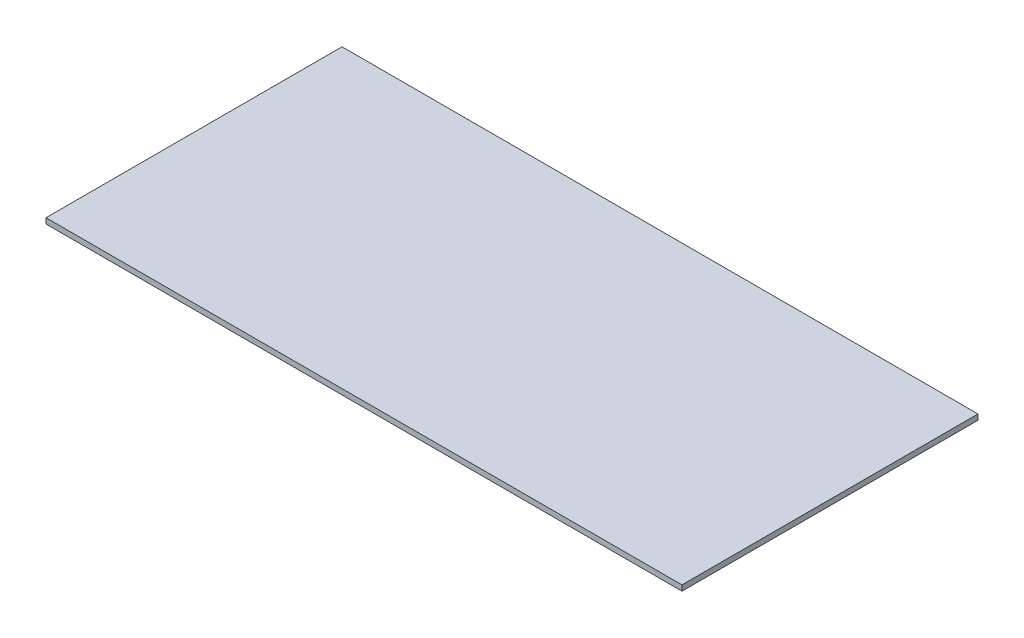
ISO-10303-21;
HEADER;
FILE_DESCRIPTION(('STEP AP214'),'2;1');
FILE_NAME('part.step','',(''),(''),'','','');
FILE_SCHEMA(('AUTOMOTIVE_DESIGN { 1 0 10303 214 1 1 1 1 }'));
ENDSEC;
DATA;
#1=APPLICATION_CONTEXT('core data for automotive mechanical design processes');
#2=APPLICATION_PROTOCOL_DEFINITION('international standard','automotive_design',2000,#1);
#3=PRODUCT_CONTEXT('',#1,'mechanical');
#4=PRODUCT('Part','Part','',(#3));
#5=PRODUCT_RELATED_PRODUCT_CATEGORY('part','',(#4));
#6=PRODUCT_DEFINITION_FORMATION('','',#4);
#7=PRODUCT_DEFINITION_CONTEXT('part definition',#1,'design');
#8=PRODUCT_DEFINITION('design','',#6,#7);
#9=PRODUCT_DEFINITION_SHAPE('','',#8);
#10=(LENGTH_UNIT() NAMED_UNIT(*) SI_UNIT(.MILLI.,.METRE.));
#11=(NAMED_UNIT(*) PLANE_ANGLE_UNIT() SI_UNIT($,.RADIAN.));
#12=(NAMED_UNIT(*) SI_UNIT($,.STERADIAN.) SOLID_ANGLE_UNIT());
#13=UNCERTAINTY_MEASURE_WITH_UNIT(LENGTH_MEASURE(1.E-05),#10,'distance_accuracy_value','');
#14=(GEOMETRIC_REPRESENTATION_CONTEXT(3) GLOBAL_UNCERTAINTY_ASSIGNED_CONTEXT((#13)) GLOBAL_UNIT_ASSIGNED_CONTEXT((#10,
#11,#12)) REPRESENTATION_CONTEXT('',''));
#15=CARTESIAN_POINT('',(0.,0.,0.));
#16=DIRECTION('',(0.,0.,1.));
#17=DIRECTION('',(1.,0.,0.));
#18=AXIS2_PLACEMENT_3D('',#15,#16,#17);
#19=CARTESIAN_POINT('',(290.,5.,135.));
#20=DIRECTION('',(-1.,0.,0.));
#21=DIRECTION('',(0.,0.,1.));
#22=AXIS2_PLACEMENT_3D('',#19,#20,#21);
#23=PLANE('',#22);
#24=DIRECTION('',(0.,0.,-1.));
#25=VECTOR('',#24,1.);
#26=CARTESIAN_POINT('',(290.,0.,135.));
#27=LINE('',#26,#25);
#28=CARTESIAN_POINT('',(290.,0.,135.));
#29=VERTEX_POINT('',#28);
#30=CARTESIAN_POINT('',(290.,0.,-135.));
#31=VERTEX_POINT('',#30);
#32=EDGE_CURVE('E103',#29,#31,#27,.T.);
#33=ORIENTED_EDGE('',*,*,#32,.T.);
#34=DIRECTION('',(0.,-1.,0.));
#35=VECTOR('',#34,1.);
#36=CARTESIAN_POINT('',(290.,5.,-135.));
#37=LINE('',#36,#35);
#38=CARTESIAN_POINT('',(290.,5.,-135.));
#39=VERTEX_POINT('',#38);
#40=EDGE_CURVE('E11',#39,#31,#37,.T.);
#41=ORIENTED_EDGE('',*,*,#40,.F.);
#42=DIRECTION('',(0.,0.,-1.));
#43=VECTOR('',#42,1.);
#44=CARTESIAN_POINT('',(290.,5.,135.));
#45=LINE('',#44,#43);
#46=CARTESIAN_POINT('',(290.,5.,135.));
#47=VERTEX_POINT('',#46);
#48=EDGE_CURVE('E90',#47,#39,#45,.T.);
#49=ORIENTED_EDGE('',*,*,#48,.F.);
#50=DIRECTION('',(0.,-1.,0.));
#51=VECTOR('',#50,1.);
#52=CARTESIAN_POINT('',(290.,5.,135.));
#53=LINE('',#52,#51);
#54=EDGE_CURVE('E99',#47,#29,#53,.T.);
#55=ORIENTED_EDGE('',*,*,#54,.T.);
#56=EDGE_LOOP('',(#33,#41,#49,#55));
#57=FACE_BOUND('',#56,.T.);
#58=ADVANCED_FACE('F39',(#57),#23,.F.);
#59=CARTESIAN_POINT('',(-290.,5.,-135.));
#60=DIRECTION('',(0.,0.,1.));
#61=DIRECTION('',(1.,0.,0.));
#62=AXIS2_PLACEMENT_3D('',#59,#60,#61);
#63=PLANE('',#62);
#64=DIRECTION('',(-1.,0.,0.));
#65=VECTOR('',#64,1.);
#66=CARTESIAN_POINT('',(-290.,0.,-135.));
#67=LINE('',#66,#65);
#68=CARTESIAN_POINT('',(-290.,0.,-135.));
#69=VERTEX_POINT('',#68);
#70=EDGE_CURVE('E94',#31,#69,#67,.T.);
#71=ORIENTED_EDGE('',*,*,#70,.T.);
#72=DIRECTION('',(0.,-1.,0.));
#73=VECTOR('',#72,1.);
#74=CARTESIAN_POINT('',(-290.,5.,-135.));
#75=LINE('',#74,#73);
#76=CARTESIAN_POINT('',(-290.,5.,-135.));
#77=VERTEX_POINT('',#76);
#78=EDGE_CURVE('E47',#77,#69,#75,.T.);
#79=ORIENTED_EDGE('',*,*,#78,.F.);
#80=DIRECTION('',(-1.,0.,0.));
#81=VECTOR('',#80,1.);
#82=CARTESIAN_POINT('',(-290.,5.,-135.));
#83=LINE('',#82,#81);
#84=EDGE_CURVE('E85',#39,#77,#83,.T.);
#85=ORIENTED_EDGE('',*,*,#84,.F.);
#86=ORIENTED_EDGE('',*,*,#40,.T.);
#87=EDGE_LOOP('',(#71,#79,#85,#86));
#88=FACE_BOUND('',#87,.T.);
#89=ADVANCED_FACE('F93',(#88),#63,.F.);
#90=CARTESIAN_POINT('',(-290.,5.,135.));
#91=DIRECTION('',(1.,0.,0.));
#92=DIRECTION('',(0.,0.,-1.));
#93=AXIS2_PLACEMENT_3D('',#90,#91,#92);
#94=PLANE('',#93);
#95=DIRECTION('',(0.,0.,1.));
#96=VECTOR('',#95,1.);
#97=CARTESIAN_POINT('',(-290.,0.,135.));
#98=LINE('',#97,#96);
#99=CARTESIAN_POINT('',(-290.,0.,135.));
#100=VERTEX_POINT('',#99);
#101=EDGE_CURVE('E72',#69,#100,#98,.T.);
#102=ORIENTED_EDGE('',*,*,#101,.T.);
#103=DIRECTION('',(0.,-1.,0.));
#104=VECTOR('',#103,1.);
#105=CARTESIAN_POINT('',(-290.,5.,135.));
#106=LINE('',#105,#104);
#107=CARTESIAN_POINT('',(-290.,5.,135.));
#108=VERTEX_POINT('',#107);
#109=EDGE_CURVE('E95',#108,#100,#106,.T.);
#110=ORIENTED_EDGE('',*,*,#109,.F.);
#111=DIRECTION('',(0.,0.,1.));
#112=VECTOR('',#111,1.);
#113=CARTESIAN_POINT('',(-290.,5.,135.));
#114=LINE('',#113,#112);
#115=EDGE_CURVE('E88',#77,#108,#114,.T.);
#116=ORIENTED_EDGE('',*,*,#115,.F.);
#117=ORIENTED_EDGE('',*,*,#78,.T.);
#118=EDGE_LOOP('',(#102,#110,#116,#117));
#119=FACE_BOUND('',#118,.T.);
#120=ADVANCED_FACE('F96',(#119),#94,.F.);
#121=CARTESIAN_POINT('',(-290.,5.,135.));
#122=DIRECTION('',(0.,0.,-1.));
#123=DIRECTION('',(-1.,0.,0.));
#124=AXIS2_PLACEMENT_3D('',#121,#122,#123);
#125=PLANE('',#124);
#126=DIRECTION('',(1.,0.,0.));
#127=VECTOR('',#126,1.);
#128=CARTESIAN_POINT('',(-290.,0.,135.));
#129=LINE('',#128,#127);
#130=EDGE_CURVE('E78',#100,#29,#129,.T.);
#131=ORIENTED_EDGE('',*,*,#130,.T.);
#132=ORIENTED_EDGE('',*,*,#54,.F.);
#133=DIRECTION('',(1.,0.,0.));
#134=VECTOR('',#133,1.);
#135=CARTESIAN_POINT('',(-290.,5.,135.));
#136=LINE('',#135,#134);
#137=EDGE_CURVE('E55',#108,#47,#136,.T.);
#138=ORIENTED_EDGE('',*,*,#137,.F.);
#139=ORIENTED_EDGE('',*,*,#109,.T.);
#140=EDGE_LOOP('',(#131,#132,#138,#139));
#141=FACE_BOUND('',#140,.T.);
#142=ADVANCED_FACE('F110',(#141),#125,.F.);
#143=CARTESIAN_POINT('',(0.,5.,0.));
#144=DIRECTION('',(0.,-1.,0.));
#145=DIRECTION('',(0.,0.,-1.));
#146=AXIS2_PLACEMENT_3D('',#143,#144,#145);
#147=PLANE('',#146);
#148=ORIENTED_EDGE('',*,*,#48,.T.);
#149=ORIENTED_EDGE('',*,*,#84,.T.);
#150=ORIENTED_EDGE('',*,*,#115,.T.);
#151=ORIENTED_EDGE('',*,*,#137,.T.);
#152=EDGE_LOOP('',(#148,#149,#150,#151));
#153=FACE_BOUND('',#152,.T.);
#154=ADVANCED_FACE('F86',(#153),#147,.F.);
#155=CARTESIAN_POINT('',(0.,0.,0.));
#156=DIRECTION('',(0.,-1.,0.));
#157=DIRECTION('',(0.,0.,-1.));
#158=AXIS2_PLACEMENT_3D('',#155,#156,#157);
#159=PLANE('',#158);
#160=ORIENTED_EDGE('',*,*,#32,.F.);
#161=ORIENTED_EDGE('',*,*,#130,.F.);
#162=ORIENTED_EDGE('',*,*,#101,.F.);
#163=ORIENTED_EDGE('',*,*,#70,.F.);
#164=EDGE_LOOP('',(#160,#161,#162,#163));
#165=FACE_BOUND('',#164,.T.);
#166=ADVANCED_FACE('F113',(#165),#159,.T.);
#167=CLOSED_SHELL('',(#58,#89,#120,#142,#154,#166));
#168=MANIFOLD_SOLID_BREP('B2',#167);
#169=ADVANCED_BREP_SHAPE_REPRESENTATION('',(#18,#168),#14);
#170=SHAPE_DEFINITION_REPRESENTATION(#9,#169);
ENDSEC;
END-ISO-10303-21;
